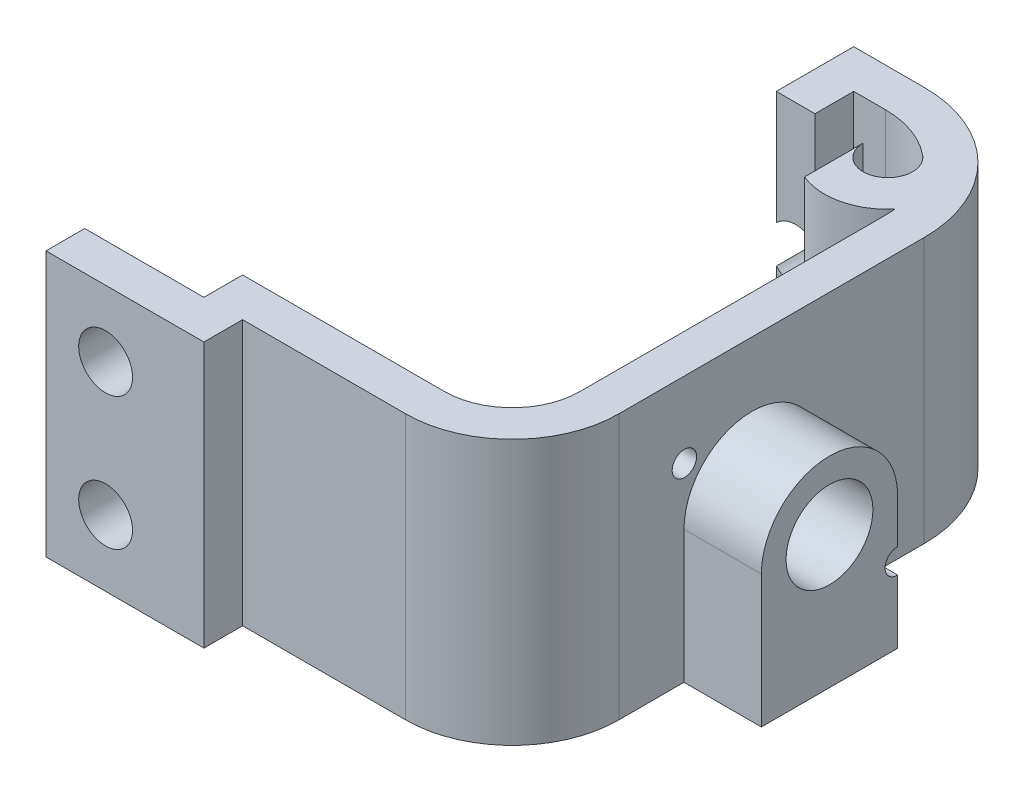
ISO-10303-21;
HEADER;
FILE_DESCRIPTION(('STEP AP214'),'2;1');
FILE_NAME('part.step','',(''),(''),'','','');
FILE_SCHEMA(('AUTOMOTIVE_DESIGN { 1 0 10303 214 1 1 1 1 }'));
ENDSEC;
DATA;
#1=APPLICATION_CONTEXT('core data for automotive mechanical design processes');
#2=APPLICATION_PROTOCOL_DEFINITION('international standard','automotive_design',2000,#1);
#3=PRODUCT_CONTEXT('',#1,'mechanical');
#4=PRODUCT('Part','Part','',(#3));
#5=PRODUCT_RELATED_PRODUCT_CATEGORY('part','',(#4));
#6=PRODUCT_DEFINITION_FORMATION('','',#4);
#7=PRODUCT_DEFINITION_CONTEXT('part definition',#1,'design');
#8=PRODUCT_DEFINITION('design','',#6,#7);
#9=PRODUCT_DEFINITION_SHAPE('','',#8);
#10=(LENGTH_UNIT() NAMED_UNIT(*) SI_UNIT(.MILLI.,.METRE.));
#11=(NAMED_UNIT(*) PLANE_ANGLE_UNIT() SI_UNIT($,.RADIAN.));
#12=(NAMED_UNIT(*) SI_UNIT($,.STERADIAN.) SOLID_ANGLE_UNIT());
#13=UNCERTAINTY_MEASURE_WITH_UNIT(LENGTH_MEASURE(1.E-05),#10,'distance_accuracy_value','');
#14=(GEOMETRIC_REPRESENTATION_CONTEXT(3) GLOBAL_UNCERTAINTY_ASSIGNED_CONTEXT((#13)) GLOBAL_UNIT_ASSIGNED_CONTEXT((#10,
#11,#12)) REPRESENTATION_CONTEXT('',''));
#15=CARTESIAN_POINT('',(0.,0.,0.));
#16=DIRECTION('',(0.,0.,1.));
#17=DIRECTION('',(1.,0.,0.));
#18=AXIS2_PLACEMENT_3D('',#15,#16,#17);
#19=CARTESIAN_POINT('',(21.2263122,21.75,-33.787820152));
#20=DIRECTION('',(0.,-1.,0.));
#21=DIRECTION('',(0.,0.,-1.));
#22=AXIS2_PLACEMENT_3D('',#19,#20,#21);
#23=CYLINDRICAL_SURFACE('',#22,7.49898779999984);
#24=DIRECTION('',(0.,-1.,0.));
#25=VECTOR('',#24,1.);
#26=CARTESIAN_POINT('',(28.6801820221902,30.7896564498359,-34.6091865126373));
#27=LINE('',#26,#25);
#28=CARTESIAN_POINT('',(28.6801820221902,21.75,-34.6091865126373));
#29=VERTEX_POINT('',#28);
#30=CARTESIAN_POINT('',(28.6801820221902,0.,-34.6091865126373));
#31=VERTEX_POINT('',#30);
#32=EDGE_CURVE('E260',#29,#31,#27,.T.);
#33=ORIENTED_EDGE('',*,*,#32,.T.);
#34=CARTESIAN_POINT('',(21.2263122,0.,-33.787820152));
#35=DIRECTION('',(0.,1.,0.));
#36=DIRECTION('',(0.,0.,1.));
#37=AXIS2_PLACEMENT_3D('',#34,#35,#36);
#38=CIRCLE('',#37,7.49898779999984);
#39=CARTESIAN_POINT('',(28.7252999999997,0.,-33.787820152));
#40=VERTEX_POINT('',#39);
#41=EDGE_CURVE('E327',#40,#31,#38,.T.);
#42=ORIENTED_EDGE('',*,*,#41,.F.);
#43=DIRECTION('',(0.,-1.,0.));
#44=VECTOR('',#43,1.);
#45=CARTESIAN_POINT('',(28.7252999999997,21.75,-33.787820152));
#46=LINE('',#45,#44);
#47=CARTESIAN_POINT('',(28.7252999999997,21.75,-33.787820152));
#48=VERTEX_POINT('',#47);
#49=EDGE_CURVE('E271',#48,#40,#46,.T.);
#50=ORIENTED_EDGE('',*,*,#49,.F.);
#51=CARTESIAN_POINT('',(21.2263122,21.75,-33.787820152));
#52=DIRECTION('',(0.,1.,0.));
#53=DIRECTION('',(0.,0.,1.));
#54=AXIS2_PLACEMENT_3D('',#51,#52,#53);
#55=CIRCLE('',#54,7.49898779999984);
#56=EDGE_CURVE('E253',#48,#29,#55,.T.);
#57=ORIENTED_EDGE('',*,*,#56,.T.);
#58=EDGE_LOOP('',(#33,#42,#50,#57));
#59=FACE_BOUND('',#58,.T.);
#60=ADVANCED_FACE('F38',(#59),#23,.F.);
#61=CARTESIAN_POINT('',(15.4504200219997,21.75,-44.461807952));
#62=DIRECTION('',(1.,0.,0.));
#63=DIRECTION('',(0.,0.,-1.));
#64=AXIS2_PLACEMENT_3D('',#61,#62,#63);
#65=PLANE('',#64);
#66=DIRECTION('',(0.,-1.,0.));
#67=VECTOR('',#66,1.);
#68=CARTESIAN_POINT('',(15.4504200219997,21.75,-44.461807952));
#69=LINE('',#68,#67);
#70=CARTESIAN_POINT('',(15.4504200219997,21.75,-44.461807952));
#71=VERTEX_POINT('',#70);
#72=CARTESIAN_POINT('',(15.4504200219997,12.4122247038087,-44.4618079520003));
#73=VERTEX_POINT('',#72);
#74=EDGE_CURVE('E377',#71,#73,#69,.T.);
#75=ORIENTED_EDGE('',*,*,#74,.T.);
#76=DIRECTION('',(0.,0.,1.));
#77=VECTOR('',#76,1.);
#78=CARTESIAN_POINT('',(15.4504200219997,12.4122247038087,-44.4618079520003));
#79=LINE('',#78,#77);
#80=CARTESIAN_POINT('',(15.4504200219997,12.4122247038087,-38.111807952));
#81=VERTEX_POINT('',#80);
#82=EDGE_CURVE('E480',#73,#81,#79,.T.);
#83=ORIENTED_EDGE('',*,*,#82,.T.);
#84=DIRECTION('',(0.,-1.,0.));
#85=VECTOR('',#84,1.);
#86=CARTESIAN_POINT('',(15.4504200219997,21.75,-38.111807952));
#87=LINE('',#86,#85);
#88=CARTESIAN_POINT('',(15.4504200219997,21.75,-38.111807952));
#89=VERTEX_POINT('',#88);
#90=EDGE_CURVE('E373',#89,#81,#87,.T.);
#91=ORIENTED_EDGE('',*,*,#90,.F.);
#92=DIRECTION('',(0.,0.,1.));
#93=VECTOR('',#92,1.);
#94=CARTESIAN_POINT('',(15.4504200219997,21.75,-44.461807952));
#95=LINE('',#94,#93);
#96=EDGE_CURVE('E430',#71,#89,#95,.T.);
#97=ORIENTED_EDGE('',*,*,#96,.F.);
#98=EDGE_LOOP('',(#75,#83,#91,#97));
#99=FACE_BOUND('',#98,.T.);
#100=ADVANCED_FACE('F573',(#99),#65,.F.);
#101=CARTESIAN_POINT('',(15.4504200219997,21.75,-38.111807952));
#102=DIRECTION('',(0.,0.,-1.));
#103=DIRECTION('',(-1.,0.,0.));
#104=AXIS2_PLACEMENT_3D('',#101,#102,#103);
#105=PLANE('',#104);
#106=ORIENTED_EDGE('',*,*,#90,.T.);
#107=CARTESIAN_POINT('',(17.0379200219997,10.875,-38.111807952));
#108=DIRECTION('',(0.,0.,1.));
#109=DIRECTION('',(1.,0.,0.));
#110=AXIS2_PLACEMENT_3D('',#107,#108,#109);
#111=CIRCLE('',#110,2.2098);
#112=CARTESIAN_POINT('',(18.6254200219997,12.4122247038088,-38.111807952));
#113=VERTEX_POINT('',#112);
#114=EDGE_CURVE('E472',#113,#81,#111,.T.);
#115=ORIENTED_EDGE('',*,*,#114,.F.);
#116=DIRECTION('',(0.,-1.,0.));
#117=VECTOR('',#116,1.);
#118=CARTESIAN_POINT('',(18.6254200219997,21.75,-38.111807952));
#119=LINE('',#118,#117);
#120=CARTESIAN_POINT('',(18.6254200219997,21.75,-38.111807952));
#121=VERTEX_POINT('',#120);
#122=EDGE_CURVE('E369',#121,#113,#119,.T.);
#123=ORIENTED_EDGE('',*,*,#122,.F.);
#124=DIRECTION('',(1.,0.,0.));
#125=VECTOR('',#124,1.);
#126=CARTESIAN_POINT('',(15.4504200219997,21.75,-38.111807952));
#127=LINE('',#126,#125);
#128=EDGE_CURVE('E432',#89,#121,#127,.T.);
#129=ORIENTED_EDGE('',*,*,#128,.F.);
#130=EDGE_LOOP('',(#106,#115,#123,#129));
#131=FACE_BOUND('',#130,.T.);
#132=ADVANCED_FACE('F578',(#131),#105,.F.);
#133=CARTESIAN_POINT('',(18.6254200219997,21.75,-41.286807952));
#134=DIRECTION('',(1.,0.,0.));
#135=DIRECTION('',(0.,0.,-1.));
#136=AXIS2_PLACEMENT_3D('',#133,#134,#135);
#137=PLANE('',#136);
#138=DIRECTION('',(0.,0.,1.));
#139=VECTOR('',#138,1.);
#140=CARTESIAN_POINT('',(18.6254200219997,12.4122247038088,-44.4618079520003));
#141=LINE('',#140,#139);
#142=CARTESIAN_POINT('',(18.6254200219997,12.4122247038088,-41.286807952));
#143=VERTEX_POINT('',#142);
#144=EDGE_CURVE('E475',#143,#113,#141,.T.);
#145=ORIENTED_EDGE('',*,*,#144,.F.);
#146=DIRECTION('',(0.,-1.,0.));
#147=VECTOR('',#146,1.);
#148=CARTESIAN_POINT('',(18.6254200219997,21.75,-41.286807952));
#149=LINE('',#148,#147);
#150=CARTESIAN_POINT('',(18.6254200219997,21.75,-41.286807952));
#151=VERTEX_POINT('',#150);
#152=EDGE_CURVE('E365',#151,#143,#149,.T.);
#153=ORIENTED_EDGE('',*,*,#152,.F.);
#154=DIRECTION('',(0.,0.,1.));
#155=VECTOR('',#154,1.);
#156=CARTESIAN_POINT('',(18.6254200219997,21.75,-41.286807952));
#157=LINE('',#156,#155);
#158=EDGE_CURVE('E433',#151,#121,#157,.T.);
#159=ORIENTED_EDGE('',*,*,#158,.T.);
#160=ORIENTED_EDGE('',*,*,#122,.T.);
#161=EDGE_LOOP('',(#145,#153,#159,#160));
#162=FACE_BOUND('',#161,.T.);
#163=ADVANCED_FACE('F597',(#162),#137,.T.);
#164=CARTESIAN_POINT('',(31.9003000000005,21.75,-8.73980802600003));
#165=DIRECTION('',(-1.,0.,0.));
#166=DIRECTION('',(0.,0.,1.));
#167=AXIS2_PLACEMENT_3D('',#164,#165,#166);
#168=PLANE('',#167);
#169=CARTESIAN_POINT('',(31.9003000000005,15.5352101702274,-14.1224918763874));
#170=DIRECTION('',(1.,0.,0.));
#171=DIRECTION('',(0.,0.,-1.));
#172=AXIS2_PLACEMENT_3D('',#169,#170,#171);
#173=CIRCLE('',#172,0.999997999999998);
#174=CARTESIAN_POINT('',(31.9003000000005,15.5352101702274,-15.1224898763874));
#175=VERTEX_POINT('',#174);
#176=EDGE_CURVE('E531',#175,#175,#173,.T.);
#177=ORIENTED_EDGE('',*,*,#176,.F.);
#178=EDGE_LOOP('',(#177));
#179=FACE_BOUND('',#178,.T.);
#180=CARTESIAN_POINT('',(31.9003000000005,10.875,-19.676314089));
#181=DIRECTION('',(1.,0.,0.));
#182=DIRECTION('',(0.,0.,-1.));
#183=AXIS2_PLACEMENT_3D('',#180,#181,#182);
#184=CIRCLE('',#183,5.588);
#185=CARTESIAN_POINT('',(31.9003000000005,10.875,-25.264314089));
#186=VERTEX_POINT('',#185);
#187=CARTESIAN_POINT('',(31.9003000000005,10.875,-14.088314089));
#188=VERTEX_POINT('',#187);
#189=EDGE_CURVE('E510',#186,#188,#184,.T.);
#190=ORIENTED_EDGE('',*,*,#189,.F.);
#191=DIRECTION('',(0.,-1.,0.));
#192=VECTOR('',#191,1.);
#193=CARTESIAN_POINT('',(31.9003000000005,0.,-25.264314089));
#194=LINE('',#193,#192);
#195=CARTESIAN_POINT('',(31.9003000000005,7.21420359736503,-25.264314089));
#196=VERTEX_POINT('',#195);
#197=EDGE_CURVE('E486',#186,#196,#194,.T.);
#198=ORIENTED_EDGE('',*,*,#197,.T.);
#199=CARTESIAN_POINT('',(31.9003000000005,6.2147898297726,-25.2301363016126));
#200=DIRECTION('',(1.,0.,0.));
#201=DIRECTION('',(0.,0.,-1.));
#202=AXIS2_PLACEMENT_3D('',#199,#200,#201);
#203=CIRCLE('',#202,0.999997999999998);
#204=CARTESIAN_POINT('',(31.9003000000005,5.21537606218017,-25.264314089));
#205=VERTEX_POINT('',#204);
#206=EDGE_CURVE('E298',#205,#196,#203,.T.);
#207=ORIENTED_EDGE('',*,*,#206,.F.);
#208=DIRECTION('',(0.,-1.,0.));
#209=VECTOR('',#208,1.);
#210=CARTESIAN_POINT('',(31.9003000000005,0.,-25.264314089));
#211=LINE('',#210,#209);
#212=CARTESIAN_POINT('',(31.9003000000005,0.,-25.264314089));
#213=VERTEX_POINT('',#212);
#214=EDGE_CURVE('E491',#205,#213,#211,.T.);
#215=ORIENTED_EDGE('',*,*,#214,.T.);
#216=DIRECTION('',(0.,0.,-1.));
#217=VECTOR('',#216,1.);
#218=CARTESIAN_POINT('',(31.9003000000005,0.,-8.73980802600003));
#219=LINE('',#218,#217);
#220=CARTESIAN_POINT('',(31.9003000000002,0.,-33.787820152));
#221=VERTEX_POINT('',#220);
#222=EDGE_CURVE('E304',#213,#221,#219,.T.);
#223=ORIENTED_EDGE('',*,*,#222,.T.);
#224=DIRECTION('',(0.,-1.,0.));
#225=VECTOR('',#224,1.);
#226=CARTESIAN_POINT('',(31.9003000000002,21.75,-33.787820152));
#227=LINE('',#226,#225);
#228=CARTESIAN_POINT('',(31.9003000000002,21.75,-33.787820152));
#229=VERTEX_POINT('',#228);
#230=EDGE_CURVE('E382',#229,#221,#227,.T.);
#231=ORIENTED_EDGE('',*,*,#230,.F.);
#232=DIRECTION('',(0.,0.,-1.));
#233=VECTOR('',#232,1.);
#234=CARTESIAN_POINT('',(31.9003000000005,21.75,-8.73980802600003));
#235=LINE('',#234,#233);
#236=CARTESIAN_POINT('',(31.9003000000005,21.75,-8.73980802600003));
#237=VERTEX_POINT('',#236);
#238=EDGE_CURVE('E418',#237,#229,#235,.T.);
#239=ORIENTED_EDGE('',*,*,#238,.F.);
#240=DIRECTION('',(0.,-1.,0.));
#241=VECTOR('',#240,1.);
#242=CARTESIAN_POINT('',(31.9003000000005,21.75,-8.73980802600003));
#243=LINE('',#242,#241);
#244=CARTESIAN_POINT('',(31.9003000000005,0.,-8.73980802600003));
#245=VERTEX_POINT('',#244);
#246=EDGE_CURVE('E385',#237,#245,#243,.T.);
#247=ORIENTED_EDGE('',*,*,#246,.T.);
#248=CARTESIAN_POINT('',(31.9003000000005,0.,-14.088314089));
#249=VERTEX_POINT('',#248);
#250=EDGE_CURVE('E305',#245,#249,#219,.T.);
#251=ORIENTED_EDGE('',*,*,#250,.T.);
#252=DIRECTION('',(0.,-1.,0.));
#253=VECTOR('',#252,1.);
#254=CARTESIAN_POINT('',(31.9003000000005,0.,-14.088314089));
#255=LINE('',#254,#253);
#256=EDGE_CURVE('E513',#188,#249,#255,.T.);
#257=ORIENTED_EDGE('',*,*,#256,.F.);
#258=EDGE_LOOP('',(#190,#198,#207,#215,#223,#231,#239,#247,#251,#257));
#259=FACE_BOUND('',#258,.T.);
#260=ADVANCED_FACE('F612',(#179,#259),#168,.F.);
#261=CARTESIAN_POINT('',(-3.175,21.75,3.17500000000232));
#262=DIRECTION('',(0.,0.,-1.));
#263=DIRECTION('',(-1.,0.,0.));
#264=AXIS2_PLACEMENT_3D('',#261,#262,#263);
#265=PLANE('',#264);
#266=CARTESIAN_POINT('',(1.7145,16.3125,3.17500000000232));
#267=DIRECTION('',(0.,0.,-1.));
#268=DIRECTION('',(-1.,0.,0.));
#269=AXIS2_PLACEMENT_3D('',#266,#267,#268);
#270=CIRCLE('',#269,2.2098);
#271=CARTESIAN_POINT('',(-0.4953,16.3125,3.17500000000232));
#272=VERTEX_POINT('',#271);
#273=EDGE_CURVE('E454',#272,#272,#270,.T.);
#274=ORIENTED_EDGE('',*,*,#273,.T.);
#275=EDGE_LOOP('',(#274));
#276=FACE_BOUND('',#275,.T.);
#277=CARTESIAN_POINT('',(1.7145,5.4375,3.17500000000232));
#278=DIRECTION('',(0.,0.,-1.));
#279=DIRECTION('',(-1.,0.,0.));
#280=AXIS2_PLACEMENT_3D('',#277,#278,#279);
#281=CIRCLE('',#280,2.2098);
#282=CARTESIAN_POINT('',(-0.4953,5.4375,3.17500000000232));
#283=VERTEX_POINT('',#282);
#284=EDGE_CURVE('E463',#283,#283,#281,.T.);
#285=ORIENTED_EDGE('',*,*,#284,.T.);
#286=EDGE_LOOP('',(#285));
#287=FACE_BOUND('',#286,.T.);
#288=DIRECTION('',(1.,0.,0.));
#289=VECTOR('',#288,1.);
#290=CARTESIAN_POINT('',(-3.175,0.,3.17500000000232));
#291=LINE('',#290,#289);
#292=CARTESIAN_POINT('',(-3.175,0.,3.17500000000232));
#293=VERTEX_POINT('',#292);
#294=CARTESIAN_POINT('',(9.779,0.,3.17500000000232));
#295=VERTEX_POINT('',#294);
#296=EDGE_CURVE('E294',#293,#295,#291,.T.);
#297=ORIENTED_EDGE('',*,*,#296,.T.);
#298=DIRECTION('',(0.,-1.,0.));
#299=VECTOR('',#298,1.);
#300=CARTESIAN_POINT('',(9.779,21.75,3.17500000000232));
#301=LINE('',#300,#299);
#302=CARTESIAN_POINT('',(9.779,21.75,3.17500000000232));
#303=VERTEX_POINT('',#302);
#304=EDGE_CURVE('E46',#303,#295,#301,.T.);
#305=ORIENTED_EDGE('',*,*,#304,.F.);
#306=DIRECTION('',(1.,0.,0.));
#307=VECTOR('',#306,1.);
#308=CARTESIAN_POINT('',(-3.175,21.75,3.17500000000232));
#309=LINE('',#308,#307);
#310=CARTESIAN_POINT('',(-3.175,21.75,3.17500000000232));
#311=VERTEX_POINT('',#310);
#312=EDGE_CURVE('E345',#311,#303,#309,.T.);
#313=ORIENTED_EDGE('',*,*,#312,.F.);
#314=DIRECTION('',(0.,-1.,0.));
#315=VECTOR('',#314,1.);
#316=CARTESIAN_POINT('',(-3.175,21.75,3.17500000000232));
#317=LINE('',#316,#315);
#318=EDGE_CURVE('E293',#311,#293,#317,.T.);
#319=ORIENTED_EDGE('',*,*,#318,.T.);
#320=EDGE_LOOP('',(#297,#305,#313,#319));
#321=FACE_BOUND('',#320,.T.);
#322=ADVANCED_FACE('F40',(#276,#287,#321),#265,.F.);
#323=CARTESIAN_POINT('',(9.779,21.75,3.17500000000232));
#324=DIRECTION('',(-1.,0.,0.));
#325=DIRECTION('',(0.,0.,1.));
#326=AXIS2_PLACEMENT_3D('',#323,#324,#325);
#327=PLANE('',#326);
#328=DIRECTION('',(0.,0.,-1.));
#329=VECTOR('',#328,1.);
#330=CARTESIAN_POINT('',(9.779,0.,3.17500000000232));
#331=LINE('',#330,#329);
#332=CARTESIAN_POINT('',(9.779,0.,2.8796409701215E-13));
#333=VERTEX_POINT('',#332);
#334=EDGE_CURVE('E297',#295,#333,#331,.T.);
#335=ORIENTED_EDGE('',*,*,#334,.T.);
#336=DIRECTION('',(0.,-1.,0.));
#337=VECTOR('',#336,1.);
#338=CARTESIAN_POINT('',(9.779,21.75,2.8796409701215E-13));
#339=LINE('',#338,#337);
#340=CARTESIAN_POINT('',(9.779,21.75,2.8796409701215E-13));
#341=VERTEX_POINT('',#340);
#342=EDGE_CURVE('E391',#341,#333,#339,.T.);
#343=ORIENTED_EDGE('',*,*,#342,.F.);
#344=DIRECTION('',(0.,0.,-1.));
#345=VECTOR('',#344,1.);
#346=CARTESIAN_POINT('',(9.779,21.75,3.17500000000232));
#347=LINE('',#346,#345);
#348=EDGE_CURVE('E398',#303,#341,#347,.T.);
#349=ORIENTED_EDGE('',*,*,#348,.F.);
#350=ORIENTED_EDGE('',*,*,#304,.T.);
#351=EDGE_LOOP('',(#335,#343,#349,#350));
#352=FACE_BOUND('',#351,.T.);
#353=ADVANCED_FACE('F396',(#352),#327,.F.);
#354=CARTESIAN_POINT('',(9.779,21.75,2.8796409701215E-13));
#355=DIRECTION('',(0.,0.,-1.));
#356=DIRECTION('',(-1.,0.,0.));
#357=AXIS2_PLACEMENT_3D('',#354,#355,#356);
#358=PLANE('',#357);
#359=DIRECTION('',(1.,0.,0.));
#360=VECTOR('',#359,1.);
#361=CARTESIAN_POINT('',(9.779,0.,2.8796409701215E-13));
#362=LINE('',#361,#360);
#363=CARTESIAN_POINT('',(23.160491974,0.,4.31946145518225E-13));
#364=VERTEX_POINT('',#363);
#365=EDGE_CURVE('E300',#333,#364,#362,.T.);
#366=ORIENTED_EDGE('',*,*,#365,.T.);
#367=DIRECTION('',(0.,-1.,0.));
#368=VECTOR('',#367,1.);
#369=CARTESIAN_POINT('',(23.160491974,21.75,4.31946145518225E-13));
#370=LINE('',#369,#368);
#371=CARTESIAN_POINT('',(23.160491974,21.75,4.31946145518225E-13));
#372=VERTEX_POINT('',#371);
#373=EDGE_CURVE('E388',#372,#364,#370,.T.);
#374=ORIENTED_EDGE('',*,*,#373,.F.);
#375=DIRECTION('',(1.,0.,0.));
#376=VECTOR('',#375,1.);
#377=CARTESIAN_POINT('',(9.779,21.75,2.8796409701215E-13));
#378=LINE('',#377,#376);
#379=EDGE_CURVE('E419',#341,#372,#378,.T.);
#380=ORIENTED_EDGE('',*,*,#379,.F.);
#381=ORIENTED_EDGE('',*,*,#342,.T.);
#382=EDGE_LOOP('',(#366,#374,#380,#381));
#383=FACE_BOUND('',#382,.T.);
#384=ADVANCED_FACE('F410',(#383),#358,.F.);
#385=CARTESIAN_POINT('',(23.160491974,21.75,-8.73980802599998));
#386=DIRECTION('',(0.,-1.,0.));
#387=DIRECTION('',(0.,0.,-1.));
#388=AXIS2_PLACEMENT_3D('',#385,#386,#387);
#389=CYLINDRICAL_SURFACE('',#388,8.73980802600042);
#390=CARTESIAN_POINT('',(23.160491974,0.,-8.73980802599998));
#391=DIRECTION('',(0.,1.,0.));
#392=DIRECTION('',(0.,0.,1.));
#393=AXIS2_PLACEMENT_3D('',#390,#391,#392);
#394=CIRCLE('',#393,8.73980802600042);
#395=EDGE_CURVE('E302',#364,#245,#394,.T.);
#396=ORIENTED_EDGE('',*,*,#395,.T.);
#397=ORIENTED_EDGE('',*,*,#246,.F.);
#398=CARTESIAN_POINT('',(23.160491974,21.75,-8.73980802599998));
#399=DIRECTION('',(0.,1.,0.));
#400=DIRECTION('',(0.,0.,1.));
#401=AXIS2_PLACEMENT_3D('',#398,#399,#400);
#402=CIRCLE('',#401,8.73980802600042);
#403=EDGE_CURVE('E416',#372,#237,#402,.T.);
#404=ORIENTED_EDGE('',*,*,#403,.F.);
#405=ORIENTED_EDGE('',*,*,#373,.T.);
#406=EDGE_LOOP('',(#396,#397,#404,#405));
#407=FACE_BOUND('',#406,.T.);
#408=ADVANCED_FACE('F414',(#407),#389,.T.);
#409=CARTESIAN_POINT('',(21.2263122,21.75,-33.787820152));
#410=DIRECTION('',(0.,-1.,0.));
#411=DIRECTION('',(0.,0.,-1.));
#412=AXIS2_PLACEMENT_3D('',#409,#410,#411);
#413=CYLINDRICAL_SURFACE('',#412,10.6739878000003);
#414=CARTESIAN_POINT('',(21.2263122,0.,-33.787820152));
#415=DIRECTION('',(0.,1.,0.));
#416=DIRECTION('',(0.,0.,1.));
#417=AXIS2_PLACEMENT_3D('',#414,#415,#416);
#418=CIRCLE('',#417,10.6739878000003);
#419=CARTESIAN_POINT('',(21.2263122,0.,-44.461807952));
#420=VERTEX_POINT('',#419);
#421=EDGE_CURVE('E308',#221,#420,#418,.T.);
#422=ORIENTED_EDGE('',*,*,#421,.T.);
#423=DIRECTION('',(0.,-1.,0.));
#424=VECTOR('',#423,1.);
#425=CARTESIAN_POINT('',(21.2263122,21.75,-44.461807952));
#426=LINE('',#425,#424);
#427=CARTESIAN_POINT('',(21.2263122,21.75,-44.461807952));
#428=VERTEX_POINT('',#427);
#429=EDGE_CURVE('E380',#428,#420,#426,.T.);
#430=ORIENTED_EDGE('',*,*,#429,.F.);
#431=CARTESIAN_POINT('',(21.2263122,21.75,-33.787820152));
#432=DIRECTION('',(0.,1.,0.));
#433=DIRECTION('',(0.,0.,1.));
#434=AXIS2_PLACEMENT_3D('',#431,#432,#433);
#435=CIRCLE('',#434,10.6739878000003);
#436=EDGE_CURVE('E421',#229,#428,#435,.T.);
#437=ORIENTED_EDGE('',*,*,#436,.F.);
#438=ORIENTED_EDGE('',*,*,#230,.T.);
#439=EDGE_LOOP('',(#422,#430,#437,#438));
#440=FACE_BOUND('',#439,.T.);
#441=ADVANCED_FACE('F607',(#440),#413,.T.);
#442=CARTESIAN_POINT('',(15.4504200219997,21.75,-44.461807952));
#443=DIRECTION('',(0.,0.,-1.));
#444=DIRECTION('',(-1.,0.,0.));
#445=AXIS2_PLACEMENT_3D('',#442,#443,#444);
#446=PLANE('',#445);
#447=CARTESIAN_POINT('',(17.0379200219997,10.875,-44.4618079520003));
#448=DIRECTION('',(0.,0.,1.));
#449=DIRECTION('',(1.,0.,0.));
#450=AXIS2_PLACEMENT_3D('',#447,#448,#449);
#451=CIRCLE('',#450,2.2098);
#452=CARTESIAN_POINT('',(15.4504200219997,9.33777529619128,-44.4618079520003));
#453=VERTEX_POINT('',#452);
#454=EDGE_CURVE('E469',#453,#73,#451,.T.);
#455=ORIENTED_EDGE('',*,*,#454,.T.);
#456=ORIENTED_EDGE('',*,*,#74,.F.);
#457=DIRECTION('',(1.,0.,0.));
#458=VECTOR('',#457,1.);
#459=CARTESIAN_POINT('',(15.4504200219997,21.75,-44.461807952));
#460=LINE('',#459,#458);
#461=EDGE_CURVE('E427',#71,#428,#460,.T.);
#462=ORIENTED_EDGE('',*,*,#461,.T.);
#463=ORIENTED_EDGE('',*,*,#429,.T.);
#464=DIRECTION('',(1.,0.,0.));
#465=VECTOR('',#464,1.);
#466=CARTESIAN_POINT('',(15.4504200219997,0.,-44.461807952));
#467=LINE('',#466,#465);
#468=CARTESIAN_POINT('',(15.4504200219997,0.,-44.461807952));
#469=VERTEX_POINT('',#468);
#470=EDGE_CURVE('E311',#469,#420,#467,.T.);
#471=ORIENTED_EDGE('',*,*,#470,.F.);
#472=EDGE_CURVE('E376',#453,#469,#69,.T.);
#473=ORIENTED_EDGE('',*,*,#472,.F.);
#474=EDGE_LOOP('',(#455,#456,#462,#463,#471,#473));
#475=FACE_BOUND('',#474,.T.);
#476=ADVANCED_FACE('F603',(#475),#446,.T.);
#477=CARTESIAN_POINT('',(15.4504200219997,9.33777529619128,-38.111807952));
#478=VERTEX_POINT('',#477);
#479=CARTESIAN_POINT('',(15.4504200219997,0.,-38.111807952));
#480=VERTEX_POINT('',#479);
#481=EDGE_CURVE('E372',#478,#480,#87,.T.);
#482=ORIENTED_EDGE('',*,*,#481,.F.);
#483=DIRECTION('',(0.,0.,1.));
#484=VECTOR('',#483,1.);
#485=CARTESIAN_POINT('',(15.4504200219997,9.33777529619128,-44.4618079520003));
#486=LINE('',#485,#484);
#487=EDGE_CURVE('E477',#478,#453,#486,.F.);
#488=ORIENTED_EDGE('',*,*,#487,.T.);
#489=ORIENTED_EDGE('',*,*,#472,.T.);
#490=DIRECTION('',(0.,0.,1.));
#491=VECTOR('',#490,1.);
#492=CARTESIAN_POINT('',(15.4504200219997,0.,-44.461807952));
#493=LINE('',#492,#491);
#494=EDGE_CURVE('E314',#469,#480,#493,.T.);
#495=ORIENTED_EDGE('',*,*,#494,.T.);
#496=EDGE_LOOP('',(#482,#488,#489,#495));
#497=FACE_BOUND('',#496,.T.);
#498=ADVANCED_FACE('F581',(#497),#65,.F.);
#499=CARTESIAN_POINT('',(18.6254200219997,9.33777529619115,-38.111807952));
#500=VERTEX_POINT('',#499);
#501=CARTESIAN_POINT('',(18.6254200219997,0.,-38.111807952));
#502=VERTEX_POINT('',#501);
#503=EDGE_CURVE('E368',#500,#502,#119,.T.);
#504=ORIENTED_EDGE('',*,*,#503,.F.);
#505=EDGE_CURVE('E466',#478,#500,#111,.T.);
#506=ORIENTED_EDGE('',*,*,#505,.F.);
#507=ORIENTED_EDGE('',*,*,#481,.T.);
#508=DIRECTION('',(1.,0.,0.));
#509=VECTOR('',#508,1.);
#510=CARTESIAN_POINT('',(15.4504200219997,0.,-38.111807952));
#511=LINE('',#510,#509);
#512=EDGE_CURVE('E317',#480,#502,#511,.T.);
#513=ORIENTED_EDGE('',*,*,#512,.T.);
#514=EDGE_LOOP('',(#504,#506,#507,#513));
#515=FACE_BOUND('',#514,.T.);
#516=ADVANCED_FACE('F594',(#515),#105,.F.);
#517=DIRECTION('',(0.,0.,1.));
#518=VECTOR('',#517,1.);
#519=CARTESIAN_POINT('',(18.6254200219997,9.33777529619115,-44.4618079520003));
#520=LINE('',#519,#518);
#521=CARTESIAN_POINT('',(18.6254200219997,9.33777529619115,-41.286807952));
#522=VERTEX_POINT('',#521);
#523=EDGE_CURVE('E61',#500,#522,#520,.F.);
#524=ORIENTED_EDGE('',*,*,#523,.F.);
#525=ORIENTED_EDGE('',*,*,#503,.T.);
#526=DIRECTION('',(0.,0.,1.));
#527=VECTOR('',#526,1.);
#528=CARTESIAN_POINT('',(18.6254200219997,0.,-41.286807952));
#529=LINE('',#528,#527);
#530=CARTESIAN_POINT('',(18.6254200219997,0.,-41.286807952));
#531=VERTEX_POINT('',#530);
#532=EDGE_CURVE('E320',#531,#502,#529,.T.);
#533=ORIENTED_EDGE('',*,*,#532,.F.);
#534=EDGE_CURVE('E364',#522,#531,#149,.T.);
#535=ORIENTED_EDGE('',*,*,#534,.F.);
#536=EDGE_LOOP('',(#524,#525,#533,#535));
#537=FACE_BOUND('',#536,.T.);
#538=ADVANCED_FACE('F590',(#537),#137,.T.);
#539=CARTESIAN_POINT('',(18.6254200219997,21.75,-41.286807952));
#540=DIRECTION('',(0.,0.,-1.));
#541=DIRECTION('',(-1.,0.,0.));
#542=AXIS2_PLACEMENT_3D('',#539,#540,#541);
#543=PLANE('',#542);
#544=ORIENTED_EDGE('',*,*,#152,.T.);
#545=CARTESIAN_POINT('',(17.0379200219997,10.875,-41.286807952));
#546=DIRECTION('',(0.,0.,-1.));
#547=DIRECTION('',(-1.,0.,0.));
#548=AXIS2_PLACEMENT_3D('',#545,#546,#547);
#549=CIRCLE('',#548,2.2098);
#550=EDGE_CURVE('E12',#143,#522,#549,.T.);
#551=ORIENTED_EDGE('',*,*,#550,.T.);
#552=ORIENTED_EDGE('',*,*,#534,.T.);
#553=DIRECTION('',(1.,0.,0.));
#554=VECTOR('',#553,1.);
#555=CARTESIAN_POINT('',(18.6254200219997,0.,-41.286807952));
#556=LINE('',#555,#554);
#557=CARTESIAN_POINT('',(21.2263122,0.,-41.2868079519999));
#558=VERTEX_POINT('',#557);
#559=EDGE_CURVE('E323',#531,#558,#556,.T.);
#560=ORIENTED_EDGE('',*,*,#559,.T.);
#561=DIRECTION('',(0.,-1.,0.));
#562=VECTOR('',#561,1.);
#563=CARTESIAN_POINT('',(21.2263122,21.75,-41.2868079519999));
#564=LINE('',#563,#562);
#565=CARTESIAN_POINT('',(21.2263122,21.75,-41.2868079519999));
#566=VERTEX_POINT('',#565);
#567=EDGE_CURVE('E361',#566,#558,#564,.T.);
#568=ORIENTED_EDGE('',*,*,#567,.F.);
#569=DIRECTION('',(1.,0.,0.));
#570=VECTOR('',#569,1.);
#571=CARTESIAN_POINT('',(18.6254200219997,21.75,-41.286807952));
#572=LINE('',#571,#570);
#573=EDGE_CURVE('E277',#151,#566,#572,.T.);
#574=ORIENTED_EDGE('',*,*,#573,.F.);
#575=EDGE_LOOP('',(#544,#551,#552,#560,#568,#574));
#576=FACE_BOUND('',#575,.T.);
#577=ADVANCED_FACE('F442',(#576),#543,.F.);
#578=DIRECTION('',(0.,-1.,0.));
#579=VECTOR('',#578,1.);
#580=CARTESIAN_POINT('',(26.0205008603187,30.7896564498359,-39.5541511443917));
#581=LINE('',#580,#579);
#582=CARTESIAN_POINT('',(26.0205008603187,21.75,-39.5541511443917));
#583=VERTEX_POINT('',#582);
#584=CARTESIAN_POINT('',(26.0205008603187,0.,-39.5541511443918));
#585=VERTEX_POINT('',#584);
#586=EDGE_CURVE('E448',#583,#585,#581,.T.);
#587=ORIENTED_EDGE('',*,*,#586,.F.);
#588=EDGE_CURVE('E273',#583,#566,#55,.T.);
#589=ORIENTED_EDGE('',*,*,#588,.T.);
#590=ORIENTED_EDGE('',*,*,#567,.T.);
#591=EDGE_CURVE('E326',#585,#558,#38,.T.);
#592=ORIENTED_EDGE('',*,*,#591,.F.);
#593=EDGE_LOOP('',(#587,#589,#590,#592));
#594=FACE_BOUND('',#593,.T.);
#595=ADVANCED_FACE('F447',(#594),#23,.F.);
#596=CARTESIAN_POINT('',(28.7252999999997,21.75,-8.73980802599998));
#597=DIRECTION('',(-1.,0.,0.));
#598=DIRECTION('',(0.,0.,1.));
#599=AXIS2_PLACEMENT_3D('',#596,#597,#598);
#600=PLANE('',#599);
#601=CARTESIAN_POINT('',(28.7252999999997,10.875,-19.676314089));
#602=DIRECTION('',(-1.,0.,0.));
#603=DIRECTION('',(0.,0.,1.));
#604=AXIS2_PLACEMENT_3D('',#601,#602,#603);
#605=CIRCLE('',#604,3.5625);
#606=CARTESIAN_POINT('',(28.7252999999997,10.875,-16.113814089));
#607=VERTEX_POINT('',#606);
#608=EDGE_CURVE('E483',#607,#607,#605,.F.);
#609=ORIENTED_EDGE('',*,*,#608,.T.);
#610=EDGE_LOOP('',(#609));
#611=FACE_BOUND('',#610,.T.);
#612=CARTESIAN_POINT('',(28.7252999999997,15.5352101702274,-14.1224918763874));
#613=DIRECTION('',(-1.,0.,0.));
#614=DIRECTION('',(0.,0.,1.));
#615=AXIS2_PLACEMENT_3D('',#612,#613,#614);
#616=CIRCLE('',#615,0.999997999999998);
#617=CARTESIAN_POINT('',(28.7252999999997,15.5352101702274,-13.1224938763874));
#618=VERTEX_POINT('',#617);
#619=EDGE_CURVE('E530',#618,#618,#616,.F.);
#620=ORIENTED_EDGE('',*,*,#619,.T.);
#621=EDGE_LOOP('',(#620));
#622=FACE_BOUND('',#621,.T.);
#623=CARTESIAN_POINT('',(28.7252999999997,6.2147898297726,-25.2301363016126));
#624=DIRECTION('',(-1.,0.,0.));
#625=DIRECTION('',(0.,0.,1.));
#626=AXIS2_PLACEMENT_3D('',#623,#624,#625);
#627=CIRCLE('',#626,0.999997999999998);
#628=CARTESIAN_POINT('',(28.7252999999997,6.2147898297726,-24.2301383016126));
#629=VERTEX_POINT('',#628);
#630=EDGE_CURVE('E534',#629,#629,#627,.F.);
#631=ORIENTED_EDGE('',*,*,#630,.T.);
#632=EDGE_LOOP('',(#631));
#633=FACE_BOUND('',#632,.T.);
#634=DIRECTION('',(0.,0.,-1.));
#635=VECTOR('',#634,1.);
#636=CARTESIAN_POINT('',(28.7252999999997,0.,-8.73980802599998));
#637=LINE('',#636,#635);
#638=CARTESIAN_POINT('',(28.7253000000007,0.,-8.73980802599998));
#639=VERTEX_POINT('',#638);
#640=EDGE_CURVE('E329',#639,#40,#637,.T.);
#641=ORIENTED_EDGE('',*,*,#640,.F.);
#642=DIRECTION('',(0.,-1.,0.));
#643=VECTOR('',#642,1.);
#644=CARTESIAN_POINT('',(28.7253000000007,21.75,-8.73980802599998));
#645=LINE('',#644,#643);
#646=CARTESIAN_POINT('',(28.7253000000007,21.75,-8.73980802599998));
#647=VERTEX_POINT('',#646);
#648=EDGE_CURVE('E358',#647,#639,#645,.T.);
#649=ORIENTED_EDGE('',*,*,#648,.F.);
#650=DIRECTION('',(0.,0.,-1.));
#651=VECTOR('',#650,1.);
#652=CARTESIAN_POINT('',(28.7252999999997,21.75,-8.73980802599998));
#653=LINE('',#652,#651);
#654=EDGE_CURVE('E272',#647,#48,#653,.T.);
#655=ORIENTED_EDGE('',*,*,#654,.T.);
#656=ORIENTED_EDGE('',*,*,#49,.T.);
#657=EDGE_LOOP('',(#641,#649,#655,#656));
#658=FACE_BOUND('',#657,.T.);
#659=ADVANCED_FACE('F561',(#611,#622,#633,#658),#600,.T.);
#660=CARTESIAN_POINT('',(23.160491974,21.75,-8.73980802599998));
#661=DIRECTION('',(0.,-1.,0.));
#662=DIRECTION('',(0.,0.,-1.));
#663=AXIS2_PLACEMENT_3D('',#660,#661,#662);
#664=CYLINDRICAL_SURFACE('',#663,5.56480802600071);
#665=CARTESIAN_POINT('',(23.160491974,0.,-8.73980802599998));
#666=DIRECTION('',(0.,1.,0.));
#667=DIRECTION('',(0.,0.,1.));
#668=AXIS2_PLACEMENT_3D('',#665,#666,#667);
#669=CIRCLE('',#668,5.56480802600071);
#670=CARTESIAN_POINT('',(23.160491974,0.,-3.17499999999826));
#671=VERTEX_POINT('',#670);
#672=EDGE_CURVE('E332',#671,#639,#669,.T.);
#673=ORIENTED_EDGE('',*,*,#672,.F.);
#674=DIRECTION('',(0.,-1.,0.));
#675=VECTOR('',#674,1.);
#676=CARTESIAN_POINT('',(23.160491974,21.75,-3.17499999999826));
#677=LINE('',#676,#675);
#678=CARTESIAN_POINT('',(23.160491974,21.75,-3.17499999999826));
#679=VERTEX_POINT('',#678);
#680=EDGE_CURVE('E356',#679,#671,#677,.T.);
#681=ORIENTED_EDGE('',*,*,#680,.F.);
#682=CARTESIAN_POINT('',(23.160491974,21.75,-8.73980802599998));
#683=DIRECTION('',(0.,1.,0.));
#684=DIRECTION('',(0.,0.,1.));
#685=AXIS2_PLACEMENT_3D('',#682,#683,#684);
#686=CIRCLE('',#685,5.56480802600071);
#687=EDGE_CURVE('E275',#679,#647,#686,.T.);
#688=ORIENTED_EDGE('',*,*,#687,.T.);
#689=ORIENTED_EDGE('',*,*,#648,.T.);
#690=EDGE_LOOP('',(#673,#681,#688,#689));
#691=FACE_BOUND('',#690,.T.);
#692=ADVANCED_FACE('F558',(#691),#664,.F.);
#693=CARTESIAN_POINT('',(6.604,21.75,-3.17499999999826));
#694=DIRECTION('',(0.,0.,-1.));
#695=DIRECTION('',(-1.,0.,0.));
#696=AXIS2_PLACEMENT_3D('',#693,#694,#695);
#697=PLANE('',#696);
#698=DIRECTION('',(1.,0.,0.));
#699=VECTOR('',#698,1.);
#700=CARTESIAN_POINT('',(6.604,0.,-3.17499999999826));
#701=LINE('',#700,#699);
#702=CARTESIAN_POINT('',(6.604,0.,-3.17499999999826));
#703=VERTEX_POINT('',#702);
#704=EDGE_CURVE('E335',#703,#671,#701,.T.);
#705=ORIENTED_EDGE('',*,*,#704,.F.);
#706=DIRECTION('',(0.,-1.,0.));
#707=VECTOR('',#706,1.);
#708=CARTESIAN_POINT('',(6.604,21.75,-3.17499999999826));
#709=LINE('',#708,#707);
#710=CARTESIAN_POINT('',(6.604,21.75,-3.17499999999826));
#711=VERTEX_POINT('',#710);
#712=EDGE_CURVE('E354',#711,#703,#709,.T.);
#713=ORIENTED_EDGE('',*,*,#712,.F.);
#714=DIRECTION('',(1.,0.,0.));
#715=VECTOR('',#714,1.);
#716=CARTESIAN_POINT('',(6.604,21.75,-3.17499999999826));
#717=LINE('',#716,#715);
#718=EDGE_CURVE('E283',#711,#679,#717,.T.);
#719=ORIENTED_EDGE('',*,*,#718,.T.);
#720=ORIENTED_EDGE('',*,*,#680,.T.);
#721=EDGE_LOOP('',(#705,#713,#719,#720));
#722=FACE_BOUND('',#721,.T.);
#723=ADVANCED_FACE('F552',(#722),#697,.T.);
#724=CARTESIAN_POINT('',(6.604,21.75,-3.17499999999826));
#725=DIRECTION('',(1.,0.,0.));
#726=DIRECTION('',(0.,0.,-1.));
#727=AXIS2_PLACEMENT_3D('',#724,#725,#726);
#728=PLANE('',#727);
#729=DIRECTION('',(0.,0.,1.));
#730=VECTOR('',#729,1.);
#731=CARTESIAN_POINT('',(6.604,0.,-3.17499999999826));
#732=LINE('',#731,#730);
#733=CARTESIAN_POINT('',(6.604,0.,0.));
#734=VERTEX_POINT('',#733);
#735=EDGE_CURVE('E338',#703,#734,#732,.T.);
#736=ORIENTED_EDGE('',*,*,#735,.T.);
#737=DIRECTION('',(0.,-1.,0.));
#738=VECTOR('',#737,1.);
#739=CARTESIAN_POINT('',(6.604,21.75,0.));
#740=LINE('',#739,#738);
#741=CARTESIAN_POINT('',(6.604,21.75,0.));
#742=VERTEX_POINT('',#741);
#743=EDGE_CURVE('E351',#742,#734,#740,.T.);
#744=ORIENTED_EDGE('',*,*,#743,.F.);
#745=DIRECTION('',(0.,0.,1.));
#746=VECTOR('',#745,1.);
#747=CARTESIAN_POINT('',(6.604,21.75,-3.17499999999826));
#748=LINE('',#747,#746);
#749=EDGE_CURVE('E286',#711,#742,#748,.T.);
#750=ORIENTED_EDGE('',*,*,#749,.F.);
#751=ORIENTED_EDGE('',*,*,#712,.T.);
#752=EDGE_LOOP('',(#736,#744,#750,#751));
#753=FACE_BOUND('',#752,.T.);
#754=ADVANCED_FACE('F562',(#753),#728,.F.);
#755=CARTESIAN_POINT('',(0.,21.75,0.));
#756=DIRECTION('',(0.,0.,1.));
#757=DIRECTION('',(1.,0.,0.));
#758=AXIS2_PLACEMENT_3D('',#755,#756,#757);
#759=PLANE('',#758);
#760=CARTESIAN_POINT('',(1.7145,16.3125,0.));
#761=DIRECTION('',(0.,0.,-1.));
#762=DIRECTION('',(-1.,0.,0.));
#763=AXIS2_PLACEMENT_3D('',#760,#761,#762);
#764=CIRCLE('',#763,2.2098);
#765=CARTESIAN_POINT('',(-0.495300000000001,16.3125,0.));
#766=VERTEX_POINT('',#765);
#767=EDGE_CURVE('E450',#766,#766,#764,.T.);
#768=ORIENTED_EDGE('',*,*,#767,.F.);
#769=EDGE_LOOP('',(#768));
#770=FACE_BOUND('',#769,.T.);
#771=CARTESIAN_POINT('',(1.7145,5.4375,0.));
#772=DIRECTION('',(0.,0.,-1.));
#773=DIRECTION('',(-1.,0.,0.));
#774=AXIS2_PLACEMENT_3D('',#771,#772,#773);
#775=CIRCLE('',#774,2.2098);
#776=CARTESIAN_POINT('',(-0.495300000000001,5.4375,0.));
#777=VERTEX_POINT('',#776);
#778=EDGE_CURVE('E461',#777,#777,#775,.T.);
#779=ORIENTED_EDGE('',*,*,#778,.F.);
#780=EDGE_LOOP('',(#779));
#781=FACE_BOUND('',#780,.T.);
#782=DIRECTION('',(-1.,0.,0.));
#783=VECTOR('',#782,1.);
#784=CARTESIAN_POINT('',(0.,0.,0.));
#785=LINE('',#784,#783);
#786=CARTESIAN_POINT('',(-3.175,0.,0.));
#787=VERTEX_POINT('',#786);
#788=EDGE_CURVE('E341',#734,#787,#785,.T.);
#789=ORIENTED_EDGE('',*,*,#788,.T.);
#790=DIRECTION('',(0.,-1.,0.));
#791=VECTOR('',#790,1.);
#792=CARTESIAN_POINT('',(-3.175,21.75,0.));
#793=LINE('',#792,#791);
#794=CARTESIAN_POINT('',(-3.175,21.75,0.));
#795=VERTEX_POINT('',#794);
#796=EDGE_CURVE('E348',#795,#787,#793,.T.);
#797=ORIENTED_EDGE('',*,*,#796,.F.);
#798=DIRECTION('',(1.,0.,0.));
#799=VECTOR('',#798,1.);
#800=CARTESIAN_POINT('',(0.,21.75,0.));
#801=LINE('',#800,#799);
#802=EDGE_CURVE('E288',#795,#742,#801,.T.);
#803=ORIENTED_EDGE('',*,*,#802,.T.);
#804=ORIENTED_EDGE('',*,*,#743,.T.);
#805=EDGE_LOOP('',(#789,#797,#803,#804));
#806=FACE_BOUND('',#805,.T.);
#807=ADVANCED_FACE('F546',(#770,#781,#806),#759,.F.);
#808=CARTESIAN_POINT('',(-3.175,21.75,0.));
#809=DIRECTION('',(1.,0.,0.));
#810=DIRECTION('',(0.,0.,-1.));
#811=AXIS2_PLACEMENT_3D('',#808,#809,#810);
#812=PLANE('',#811);
#813=DIRECTION('',(0.,0.,1.));
#814=VECTOR('',#813,1.);
#815=CARTESIAN_POINT('',(-3.175,0.,0.));
#816=LINE('',#815,#814);
#817=EDGE_CURVE('E343',#787,#293,#816,.T.);
#818=ORIENTED_EDGE('',*,*,#817,.T.);
#819=ORIENTED_EDGE('',*,*,#318,.F.);
#820=DIRECTION('',(0.,0.,1.));
#821=VECTOR('',#820,1.);
#822=CARTESIAN_POINT('',(-3.175,21.75,0.));
#823=LINE('',#822,#821);
#824=EDGE_CURVE('E291',#795,#311,#823,.T.);
#825=ORIENTED_EDGE('',*,*,#824,.F.);
#826=ORIENTED_EDGE('',*,*,#796,.T.);
#827=EDGE_LOOP('',(#818,#819,#825,#826));
#828=FACE_BOUND('',#827,.T.);
#829=ADVANCED_FACE('F544',(#828),#812,.F.);
#830=CARTESIAN_POINT('',(23.160491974,21.75,-8.73980802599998));
#831=DIRECTION('',(0.,1.,0.));
#832=DIRECTION('',(0.,0.,1.));
#833=AXIS2_PLACEMENT_3D('',#830,#831,#832);
#834=PLANE('',#833);
#835=ORIENTED_EDGE('',*,*,#312,.T.);
#836=ORIENTED_EDGE('',*,*,#348,.T.);
#837=ORIENTED_EDGE('',*,*,#379,.T.);
#838=ORIENTED_EDGE('',*,*,#403,.T.);
#839=ORIENTED_EDGE('',*,*,#238,.T.);
#840=ORIENTED_EDGE('',*,*,#436,.T.);
#841=ORIENTED_EDGE('',*,*,#461,.F.);
#842=ORIENTED_EDGE('',*,*,#96,.T.);
#843=ORIENTED_EDGE('',*,*,#128,.T.);
#844=ORIENTED_EDGE('',*,*,#158,.F.);
#845=ORIENTED_EDGE('',*,*,#573,.T.);
#846=ORIENTED_EDGE('',*,*,#588,.F.);
#847=CARTESIAN_POINT('',(24.7214200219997,21.75,-37.9916489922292));
#848=DIRECTION('',(0.,1.,0.));
#849=DIRECTION('',(0.,0.,1.));
#850=AXIS2_PLACEMENT_3D('',#847,#848,#849);
#851=CIRCLE('',#850,2.032);
#852=CARTESIAN_POINT('',(22.6894200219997,21.75,-37.9916489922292));
#853=VERTEX_POINT('',#852);
#854=EDGE_CURVE('E451',#853,#583,#851,.T.);
#855=ORIENTED_EDGE('',*,*,#854,.F.);
#856=DIRECTION('',(0.,0.,-1.));
#857=VECTOR('',#856,1.);
#858=CARTESIAN_POINT('',(22.6894200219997,21.75,-37.9916489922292));
#859=LINE('',#858,#857);
#860=CARTESIAN_POINT('',(22.6894200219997,21.75,-33.1975041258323));
#861=VERTEX_POINT('',#860);
#862=EDGE_CURVE('E256',#861,#853,#859,.T.);
#863=ORIENTED_EDGE('',*,*,#862,.F.);
#864=CARTESIAN_POINT('',(24.7214200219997,21.75,-37.9916489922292));
#865=DIRECTION('',(0.,1.,0.));
#866=DIRECTION('',(0.,0.,1.));
#867=AXIS2_PLACEMENT_3D('',#864,#865,#866);
#868=CIRCLE('',#867,5.207);
#869=EDGE_CURVE('E247',#29,#861,#868,.F.);
#870=ORIENTED_EDGE('',*,*,#869,.F.);
#871=ORIENTED_EDGE('',*,*,#56,.F.);
#872=ORIENTED_EDGE('',*,*,#654,.F.);
#873=ORIENTED_EDGE('',*,*,#687,.F.);
#874=ORIENTED_EDGE('',*,*,#718,.F.);
#875=ORIENTED_EDGE('',*,*,#749,.T.);
#876=ORIENTED_EDGE('',*,*,#802,.F.);
#877=ORIENTED_EDGE('',*,*,#824,.T.);
#878=EDGE_LOOP('',(#835,#836,#837,#838,#839,#840,#841,#842,#843,#844,#845,#846,#855,#863,#870,
#871,#872,#873,#874,#875,#876,#877));
#879=FACE_BOUND('',#878,.T.);
#880=ADVANCED_FACE('F250',(#879),#834,.T.);
#881=CARTESIAN_POINT('',(23.160491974,0.,-8.73980802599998));
#882=DIRECTION('',(0.,1.,0.));
#883=DIRECTION('',(0.,0.,1.));
#884=AXIS2_PLACEMENT_3D('',#881,#882,#883);
#885=PLANE('',#884);
#886=ORIENTED_EDGE('',*,*,#296,.F.);
#887=ORIENTED_EDGE('',*,*,#817,.F.);
#888=ORIENTED_EDGE('',*,*,#788,.F.);
#889=ORIENTED_EDGE('',*,*,#735,.F.);
#890=ORIENTED_EDGE('',*,*,#704,.T.);
#891=ORIENTED_EDGE('',*,*,#672,.T.);
#892=ORIENTED_EDGE('',*,*,#640,.T.);
#893=ORIENTED_EDGE('',*,*,#41,.T.);
#894=CARTESIAN_POINT('',(24.7214200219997,0.,-37.9916489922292));
#895=DIRECTION('',(0.,-1.,0.));
#896=DIRECTION('',(0.,0.,-1.));
#897=AXIS2_PLACEMENT_3D('',#894,#895,#896);
#898=CIRCLE('',#897,5.207);
#899=CARTESIAN_POINT('',(22.6894200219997,0.,-33.1975041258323));
#900=VERTEX_POINT('',#899);
#901=EDGE_CURVE('E265',#31,#900,#898,.T.);
#902=ORIENTED_EDGE('',*,*,#901,.T.);
#903=DIRECTION('',(0.,0.,-1.));
#904=VECTOR('',#903,1.);
#905=CARTESIAN_POINT('',(22.6894200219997,0.,-37.9916489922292));
#906=LINE('',#905,#904);
#907=CARTESIAN_POINT('',(22.6894200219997,0.,-37.9916489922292));
#908=VERTEX_POINT('',#907);
#909=EDGE_CURVE('E269',#900,#908,#906,.T.);
#910=ORIENTED_EDGE('',*,*,#909,.T.);
#911=CARTESIAN_POINT('',(24.7214200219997,0.,-37.9916489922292));
#912=DIRECTION('',(0.,1.,0.));
#913=DIRECTION('',(0.,0.,-1.));
#914=AXIS2_PLACEMENT_3D('',#911,#912,#913);
#915=CIRCLE('',#914,2.032);
#916=EDGE_CURVE('E53',#908,#585,#915,.T.);
#917=ORIENTED_EDGE('',*,*,#916,.T.);
#918=ORIENTED_EDGE('',*,*,#591,.T.);
#919=ORIENTED_EDGE('',*,*,#559,.F.);
#920=ORIENTED_EDGE('',*,*,#532,.T.);
#921=ORIENTED_EDGE('',*,*,#512,.F.);
#922=ORIENTED_EDGE('',*,*,#494,.F.);
#923=ORIENTED_EDGE('',*,*,#470,.T.);
#924=ORIENTED_EDGE('',*,*,#421,.F.);
#925=ORIENTED_EDGE('',*,*,#222,.F.);
#926=DIRECTION('',(-1.,0.,0.));
#927=VECTOR('',#926,1.);
#928=CARTESIAN_POINT('',(38.2503000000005,0.,-25.264314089));
#929=LINE('',#928,#927);
#930=CARTESIAN_POINT('',(38.2503000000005,0.,-25.264314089));
#931=VERTEX_POINT('',#930);
#932=EDGE_CURVE('E522',#931,#213,#929,.T.);
#933=ORIENTED_EDGE('',*,*,#932,.F.);
#934=DIRECTION('',(0.,0.,-1.));
#935=VECTOR('',#934,1.);
#936=CARTESIAN_POINT('',(38.2503000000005,0.,0.));
#937=LINE('',#936,#935);
#938=CARTESIAN_POINT('',(38.2503000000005,0.,-14.088314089));
#939=VERTEX_POINT('',#938);
#940=EDGE_CURVE('E500',#939,#931,#937,.T.);
#941=ORIENTED_EDGE('',*,*,#940,.F.);
#942=DIRECTION('',(-1.,0.,0.));
#943=VECTOR('',#942,1.);
#944=CARTESIAN_POINT('',(38.2503000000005,0.,-14.088314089));
#945=LINE('',#944,#943);
#946=EDGE_CURVE('E524',#939,#249,#945,.T.);
#947=ORIENTED_EDGE('',*,*,#946,.T.);
#948=ORIENTED_EDGE('',*,*,#250,.F.);
#949=ORIENTED_EDGE('',*,*,#395,.F.);
#950=ORIENTED_EDGE('',*,*,#365,.F.);
#951=ORIENTED_EDGE('',*,*,#334,.F.);
#952=EDGE_LOOP('',(#886,#887,#888,#889,#890,#891,#892,#893,#902,#910,#917,#918,#919,#920,#921,
#922,#923,#924,#925,#933,#941,#947,#948,#949,#950,#951));
#953=FACE_BOUND('',#952,.T.);
#954=ADVANCED_FACE('F404',(#953),#885,.F.);
#955=CARTESIAN_POINT('',(-3.176,6.2147898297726,-25.2301363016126));
#956=DIRECTION('',(1.,0.,0.));
#957=DIRECTION('',(0.,0.,-1.));
#958=AXIS2_PLACEMENT_3D('',#955,#956,#957);
#959=CYLINDRICAL_SURFACE('',#958,0.999997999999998);
#960=ORIENTED_EDGE('',*,*,#630,.F.);
#961=EDGE_LOOP('',(#960));
#962=FACE_BOUND('',#961,.T.);
#963=ORIENTED_EDGE('',*,*,#206,.T.);
#964=DIRECTION('',(-1.,0.,0.));
#965=VECTOR('',#964,1.);
#966=CARTESIAN_POINT('',(38.2503000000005,7.21420359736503,-25.264314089));
#967=LINE('',#966,#965);
#968=CARTESIAN_POINT('',(38.2503000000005,7.21420359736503,-25.264314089));
#969=VERTEX_POINT('',#968);
#970=EDGE_CURVE('E507',#969,#196,#967,.T.);
#971=ORIENTED_EDGE('',*,*,#970,.F.);
#972=CARTESIAN_POINT('',(38.2503000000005,6.2147898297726,-25.2301363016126));
#973=DIRECTION('',(1.,0.,0.));
#974=DIRECTION('',(0.,0.,-1.));
#975=AXIS2_PLACEMENT_3D('',#972,#973,#974);
#976=CIRCLE('',#975,0.999997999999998);
#977=CARTESIAN_POINT('',(38.2503000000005,5.21537606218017,-25.264314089));
#978=VERTEX_POINT('',#977);
#979=EDGE_CURVE('E505',#978,#969,#976,.F.);
#980=ORIENTED_EDGE('',*,*,#979,.F.);
#981=DIRECTION('',(-1.,0.,0.));
#982=VECTOR('',#981,1.);
#983=CARTESIAN_POINT('',(38.2503000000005,5.21537606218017,-25.264314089));
#984=LINE('',#983,#982);
#985=EDGE_CURVE('E519',#978,#205,#984,.T.);
#986=ORIENTED_EDGE('',*,*,#985,.T.);
#987=EDGE_LOOP('',(#963,#971,#980,#986));
#988=FACE_BOUND('',#987,.T.);
#989=ADVANCED_FACE('F674',(#962,#988),#959,.F.);
#990=CARTESIAN_POINT('',(-3.176,15.5352101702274,-14.1224918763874));
#991=DIRECTION('',(1.,0.,0.));
#992=DIRECTION('',(0.,0.,-1.));
#993=AXIS2_PLACEMENT_3D('',#990,#991,#992);
#994=CYLINDRICAL_SURFACE('',#993,0.999997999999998);
#995=ORIENTED_EDGE('',*,*,#619,.F.);
#996=EDGE_LOOP('',(#995));
#997=FACE_BOUND('',#996,.T.);
#998=ORIENTED_EDGE('',*,*,#176,.T.);
#999=EDGE_LOOP('',(#998));
#1000=FACE_BOUND('',#999,.T.);
#1001=ADVANCED_FACE('F667',(#997,#1000),#994,.F.);
#1002=CARTESIAN_POINT('',(38.2503000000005,0.,-25.264314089));
#1003=DIRECTION('',(0.,0.,-1.));
#1004=DIRECTION('',(0.,1.,0.));
#1005=AXIS2_PLACEMENT_3D('',#1002,#1003,#1004);
#1006=PLANE('',#1005);
#1007=ORIENTED_EDGE('',*,*,#197,.F.);
#1008=DIRECTION('',(-1.,0.,0.));
#1009=VECTOR('',#1008,1.);
#1010=CARTESIAN_POINT('',(38.2503000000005,10.875,-25.264314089));
#1011=LINE('',#1010,#1009);
#1012=CARTESIAN_POINT('',(38.2503000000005,10.875,-25.264314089));
#1013=VERTEX_POINT('',#1012);
#1014=EDGE_CURVE('E528',#1013,#186,#1011,.T.);
#1015=ORIENTED_EDGE('',*,*,#1014,.F.);
#1016=DIRECTION('',(0.,-1.,0.));
#1017=VECTOR('',#1016,1.);
#1018=CARTESIAN_POINT('',(38.2503000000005,0.,-25.264314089));
#1019=LINE('',#1018,#1017);
#1020=EDGE_CURVE('E490',#1013,#969,#1019,.T.);
#1021=ORIENTED_EDGE('',*,*,#1020,.T.);
#1022=ORIENTED_EDGE('',*,*,#970,.T.);
#1023=EDGE_LOOP('',(#1007,#1015,#1021,#1022));
#1024=FACE_BOUND('',#1023,.T.);
#1025=ADVANCED_FACE('F663',(#1024),#1006,.T.);
#1026=CARTESIAN_POINT('',(38.2503000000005,10.875,-19.676314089));
#1027=DIRECTION('',(-1.,0.,0.));
#1028=DIRECTION('',(0.,0.,1.));
#1029=AXIS2_PLACEMENT_3D('',#1026,#1027,#1028);
#1030=CYLINDRICAL_SURFACE('',#1029,5.588);
#1031=ORIENTED_EDGE('',*,*,#189,.T.);
#1032=DIRECTION('',(-1.,0.,0.));
#1033=VECTOR('',#1032,1.);
#1034=CARTESIAN_POINT('',(38.2503000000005,10.875,-14.088314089));
#1035=LINE('',#1034,#1033);
#1036=CARTESIAN_POINT('',(38.2503000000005,10.875,-14.088314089));
#1037=VERTEX_POINT('',#1036);
#1038=EDGE_CURVE('E526',#1037,#188,#1035,.T.);
#1039=ORIENTED_EDGE('',*,*,#1038,.F.);
#1040=CARTESIAN_POINT('',(38.2503000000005,10.875,-19.676314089));
#1041=DIRECTION('',(1.,0.,0.));
#1042=DIRECTION('',(0.,0.,-1.));
#1043=AXIS2_PLACEMENT_3D('',#1040,#1041,#1042);
#1044=CIRCLE('',#1043,5.588);
#1045=EDGE_CURVE('E494',#1013,#1037,#1044,.T.);
#1046=ORIENTED_EDGE('',*,*,#1045,.F.);
#1047=ORIENTED_EDGE('',*,*,#1014,.T.);
#1048=EDGE_LOOP('',(#1031,#1039,#1046,#1047));
#1049=FACE_BOUND('',#1048,.T.);
#1050=ADVANCED_FACE('F659',(#1049),#1030,.T.);
#1051=CARTESIAN_POINT('',(38.2503000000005,0.,-14.088314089));
#1052=DIRECTION('',(0.,0.,-1.));
#1053=DIRECTION('',(0.,1.,0.));
#1054=AXIS2_PLACEMENT_3D('',#1051,#1052,#1053);
#1055=PLANE('',#1054);
#1056=ORIENTED_EDGE('',*,*,#256,.T.);
#1057=ORIENTED_EDGE('',*,*,#946,.F.);
#1058=DIRECTION('',(0.,-1.,0.));
#1059=VECTOR('',#1058,1.);
#1060=CARTESIAN_POINT('',(38.2503000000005,0.,-14.088314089));
#1061=LINE('',#1060,#1059);
#1062=EDGE_CURVE('E497',#1037,#939,#1061,.T.);
#1063=ORIENTED_EDGE('',*,*,#1062,.F.);
#1064=ORIENTED_EDGE('',*,*,#1038,.T.);
#1065=EDGE_LOOP('',(#1056,#1057,#1063,#1064));
#1066=FACE_BOUND('',#1065,.T.);
#1067=ADVANCED_FACE('F655',(#1066),#1055,.F.);
#1068=CARTESIAN_POINT('',(38.2503000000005,0.,-25.264314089));
#1069=DIRECTION('',(0.,0.,-1.));
#1070=DIRECTION('',(0.,1.,0.));
#1071=AXIS2_PLACEMENT_3D('',#1068,#1069,#1070);
#1072=PLANE('',#1071);
#1073=ORIENTED_EDGE('',*,*,#214,.F.);
#1074=ORIENTED_EDGE('',*,*,#985,.F.);
#1075=DIRECTION('',(0.,-1.,0.));
#1076=VECTOR('',#1075,1.);
#1077=CARTESIAN_POINT('',(38.2503000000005,0.,-25.264314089));
#1078=LINE('',#1077,#1076);
#1079=EDGE_CURVE('E502',#978,#931,#1078,.T.);
#1080=ORIENTED_EDGE('',*,*,#1079,.T.);
#1081=ORIENTED_EDGE('',*,*,#932,.T.);
#1082=EDGE_LOOP('',(#1073,#1074,#1080,#1081));
#1083=FACE_BOUND('',#1082,.T.);
#1084=ADVANCED_FACE('F652',(#1083),#1072,.T.);
#1085=CARTESIAN_POINT('',(38.2503000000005,10.875,-19.676314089));
#1086=DIRECTION('',(-1.,0.,0.));
#1087=DIRECTION('',(0.,0.,1.));
#1088=AXIS2_PLACEMENT_3D('',#1085,#1086,#1087);
#1089=CYLINDRICAL_SURFACE('',#1088,3.5625);
#1090=CARTESIAN_POINT('',(38.2503000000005,10.875,-19.676314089));
#1091=DIRECTION('',(1.,0.,0.));
#1092=DIRECTION('',(0.,0.,-1.));
#1093=AXIS2_PLACEMENT_3D('',#1090,#1091,#1092);
#1094=CIRCLE('',#1093,3.5625);
#1095=CARTESIAN_POINT('',(38.2503000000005,10.875,-23.238814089));
#1096=VERTEX_POINT('',#1095);
#1097=EDGE_CURVE('E487',#1096,#1096,#1094,.T.);
#1098=ORIENTED_EDGE('',*,*,#1097,.T.);
#1099=EDGE_LOOP('',(#1098));
#1100=FACE_BOUND('',#1099,.T.);
#1101=ORIENTED_EDGE('',*,*,#608,.F.);
#1102=EDGE_LOOP('',(#1101));
#1103=FACE_BOUND('',#1102,.T.);
#1104=ADVANCED_FACE('F650',(#1100,#1103),#1089,.F.);
#1105=CARTESIAN_POINT('',(38.2503000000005,0.,0.));
#1106=DIRECTION('',(1.,0.,0.));
#1107=DIRECTION('',(0.,0.,-1.));
#1108=AXIS2_PLACEMENT_3D('',#1105,#1106,#1107);
#1109=PLANE('',#1108);
#1110=ORIENTED_EDGE('',*,*,#1097,.F.);
#1111=EDGE_LOOP('',(#1110));
#1112=FACE_BOUND('',#1111,.T.);
#1113=ORIENTED_EDGE('',*,*,#1020,.F.);
#1114=ORIENTED_EDGE('',*,*,#1045,.T.);
#1115=ORIENTED_EDGE('',*,*,#1062,.T.);
#1116=ORIENTED_EDGE('',*,*,#940,.T.);
#1117=ORIENTED_EDGE('',*,*,#1079,.F.);
#1118=ORIENTED_EDGE('',*,*,#979,.T.);
#1119=EDGE_LOOP('',(#1113,#1114,#1115,#1116,#1117,#1118));
#1120=FACE_BOUND('',#1119,.T.);
#1121=ADVANCED_FACE('F644',(#1112,#1120),#1109,.T.);
#1122=CARTESIAN_POINT('',(17.0379200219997,10.875,-44.4618079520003));
#1123=DIRECTION('',(0.,0.,1.));
#1124=DIRECTION('',(1.,0.,0.));
#1125=AXIS2_PLACEMENT_3D('',#1122,#1123,#1124);
#1126=CYLINDRICAL_SURFACE('',#1125,2.2098);
#1127=ORIENTED_EDGE('',*,*,#454,.F.);
#1128=ORIENTED_EDGE('',*,*,#487,.F.);
#1129=ORIENTED_EDGE('',*,*,#505,.T.);
#1130=ORIENTED_EDGE('',*,*,#523,.T.);
#1131=ORIENTED_EDGE('',*,*,#550,.F.);
#1132=ORIENTED_EDGE('',*,*,#144,.T.);
#1133=ORIENTED_EDGE('',*,*,#114,.T.);
#1134=ORIENTED_EDGE('',*,*,#82,.F.);
#1135=EDGE_LOOP('',(#1127,#1128,#1129,#1130,#1131,#1132,#1133,#1134));
#1136=FACE_BOUND('',#1135,.T.);
#1137=ADVANCED_FACE('F634',(#1136),#1126,.F.);
#1138=CARTESIAN_POINT('',(1.7145,5.4375,3.17500000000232));
#1139=DIRECTION('',(0.,0.,-1.));
#1140=DIRECTION('',(-1.,0.,0.));
#1141=AXIS2_PLACEMENT_3D('',#1138,#1139,#1140);
#1142=CYLINDRICAL_SURFACE('',#1141,2.2098);
#1143=ORIENTED_EDGE('',*,*,#284,.F.);
#1144=EDGE_LOOP('',(#1143));
#1145=FACE_BOUND('',#1144,.T.);
#1146=ORIENTED_EDGE('',*,*,#778,.T.);
#1147=EDGE_LOOP('',(#1146));
#1148=FACE_BOUND('',#1147,.T.);
#1149=ADVANCED_FACE('F630',(#1145,#1148),#1142,.F.);
#1150=CARTESIAN_POINT('',(1.7145,16.3125,3.17500000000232));
#1151=DIRECTION('',(0.,0.,-1.));
#1152=DIRECTION('',(-1.,0.,0.));
#1153=AXIS2_PLACEMENT_3D('',#1150,#1151,#1152);
#1154=CYLINDRICAL_SURFACE('',#1153,2.2098);
#1155=ORIENTED_EDGE('',*,*,#273,.F.);
#1156=EDGE_LOOP('',(#1155));
#1157=FACE_BOUND('',#1156,.T.);
#1158=ORIENTED_EDGE('',*,*,#767,.T.);
#1159=EDGE_LOOP('',(#1158));
#1160=FACE_BOUND('',#1159,.T.);
#1161=ADVANCED_FACE('F633',(#1157,#1160),#1154,.F.);
#1162=CARTESIAN_POINT('',(24.7214200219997,30.7896564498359,-37.9916489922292));
#1163=DIRECTION('',(0.,-1.,0.));
#1164=DIRECTION('',(0.,0.,-1.));
#1165=AXIS2_PLACEMENT_3D('',#1162,#1163,#1164);
#1166=CYLINDRICAL_SURFACE('',#1165,5.207);
#1167=ORIENTED_EDGE('',*,*,#32,.F.);
#1168=ORIENTED_EDGE('',*,*,#869,.T.);
#1169=DIRECTION('',(0.,-1.,0.));
#1170=VECTOR('',#1169,1.);
#1171=CARTESIAN_POINT('',(22.6894200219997,30.7896564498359,-33.1975041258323));
#1172=LINE('',#1171,#1170);
#1173=EDGE_CURVE('E259',#861,#900,#1172,.T.);
#1174=ORIENTED_EDGE('',*,*,#1173,.T.);
#1175=ORIENTED_EDGE('',*,*,#901,.F.);
#1176=EDGE_LOOP('',(#1167,#1168,#1174,#1175));
#1177=FACE_BOUND('',#1176,.T.);
#1178=ADVANCED_FACE('F263',(#1177),#1166,.T.);
#1179=CARTESIAN_POINT('',(22.6894200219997,30.7896564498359,-37.9916489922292));
#1180=DIRECTION('',(-1.,0.,0.));
#1181=DIRECTION('',(0.,0.,1.));
#1182=AXIS2_PLACEMENT_3D('',#1179,#1180,#1181);
#1183=PLANE('',#1182);
#1184=ORIENTED_EDGE('',*,*,#1173,.F.);
#1185=ORIENTED_EDGE('',*,*,#862,.T.);
#1186=DIRECTION('',(0.,-1.,0.));
#1187=VECTOR('',#1186,1.);
#1188=CARTESIAN_POINT('',(22.6894200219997,30.7896564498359,-37.9916489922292));
#1189=LINE('',#1188,#1187);
#1190=EDGE_CURVE('E456',#853,#908,#1189,.T.);
#1191=ORIENTED_EDGE('',*,*,#1190,.T.);
#1192=ORIENTED_EDGE('',*,*,#909,.F.);
#1193=EDGE_LOOP('',(#1184,#1185,#1191,#1192));
#1194=FACE_BOUND('',#1193,.T.);
#1195=ADVANCED_FACE('F947',(#1194),#1183,.T.);
#1196=CARTESIAN_POINT('',(24.7214200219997,30.7896564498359,-37.9916489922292));
#1197=DIRECTION('',(0.,-1.,0.));
#1198=DIRECTION('',(0.,0.,-1.));
#1199=AXIS2_PLACEMENT_3D('',#1196,#1197,#1198);
#1200=CYLINDRICAL_SURFACE('',#1199,2.032);
#1201=ORIENTED_EDGE('',*,*,#1190,.F.);
#1202=ORIENTED_EDGE('',*,*,#854,.T.);
#1203=ORIENTED_EDGE('',*,*,#586,.T.);
#1204=ORIENTED_EDGE('',*,*,#916,.F.);
#1205=EDGE_LOOP('',(#1201,#1202,#1203,#1204));
#1206=FACE_BOUND('',#1205,.T.);
#1207=ADVANCED_FACE('F954',(#1206),#1200,.F.);
#1208=CLOSED_SHELL('',(#60,#100,#132,#163,#260,#322,#353,#384,#408,#441,#476,#498,#516,#538,
#577,#595,#659,#692,#723,#754,#807,#829,#880,#954,#989,#1001,#1025,#1050,#1067,#1084,#1104,
#1121,#1137,#1149,#1161,#1178,#1195,#1207));
#1209=MANIFOLD_SOLID_BREP('B2',#1208);
#1210=ADVANCED_BREP_SHAPE_REPRESENTATION('',(#18,#1209),#14);
#1211=SHAPE_DEFINITION_REPRESENTATION(#9,#1210);
ENDSEC;
END-ISO-10303-21;
